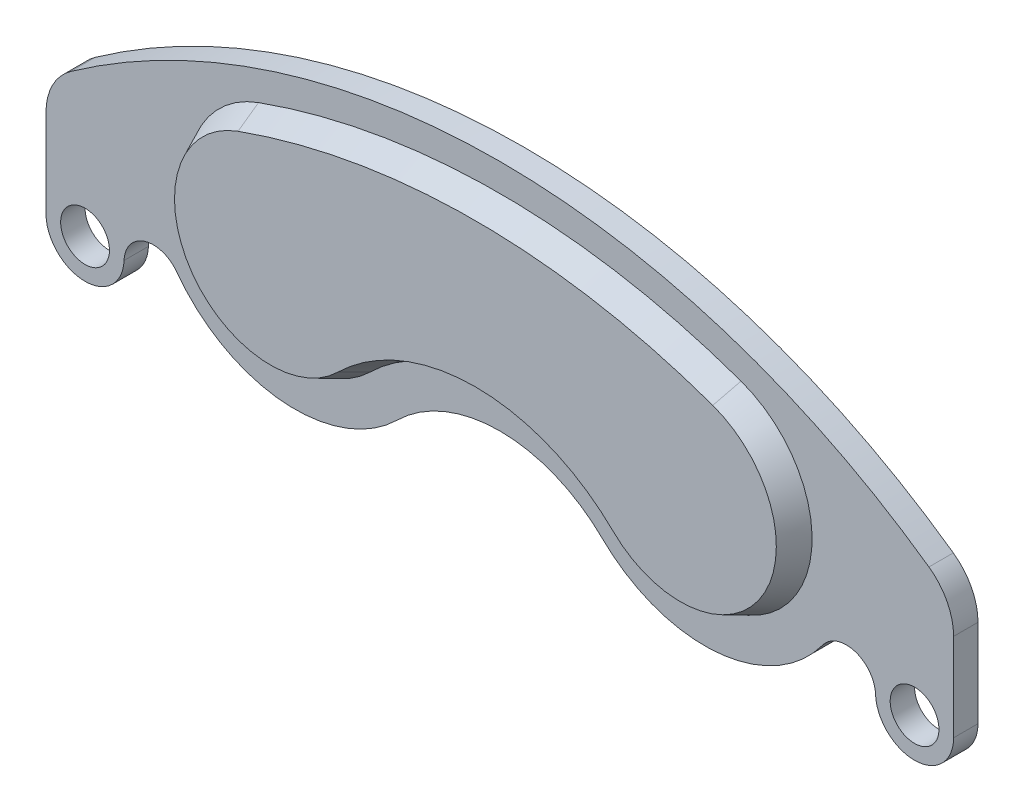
from build123d import *

# Parameters (mm, degrees)
SKETCH2_R           = 2.5
BOSS_EXTRUDE1_DEPTH = 1.25
BOSS_EXTRUDE2_DEPTH = 2.5
BOSS_EXTRUDE2_TAPER = 25


with BuildPart() as part:
    # Sketch2 → Boss-Extrude1 (new, symmetric)
    with BuildSketch(Plane.XY):
        with BuildLine():
            Line((46.5, 11.018505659), (46.5, 20.018505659))
            ThreePointArc((46.5, 20.018505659), (45.830505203, 22.772723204), (43.971428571, 24.912295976))
            ThreePointArc((43.971428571, 24.912295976), (23.074999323, 35.336607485), (0, 38.924285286))
            ThreePointArc((0, 38.924285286), (-23.074999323, 35.336607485), (-43.971428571, 24.912295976))
            ThreePointArc((-43.971428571, 24.912295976), (-45.830505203, 22.772723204), (-46.5, 20.018505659))
            Line((-46.5, 20.018505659), (-46.5, 11.018505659))
            ThreePointArc((-46.5, 11.018505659), (-42.572396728, 7.019160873), (-38.502620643, 10.873735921))
            ThreePointArc((-38.502620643, 10.873735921), (-36.387640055, 13.632250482), (-33.087155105, 12.541679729))
            ThreePointArc((-33.087155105, 12.541679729), (-22.211018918, 6.473250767), (-10.5, 10.712142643))
            ThreePointArc((-10.5, 10.712142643), (0, 15), (10.5, 10.712142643))
            ThreePointArc((10.5, 10.712142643), (22.211018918, 6.473250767), (33.087155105, 12.541679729))
            ThreePointArc((33.087155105, 12.541679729), (36.387640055, 13.632250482), (38.502620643, 10.873735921))
            ThreePointArc((38.502620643, 10.873735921), (42.572396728, 7.019160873), (46.5, 11.018505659))
        make_face()
        with Locations((-42.5, 11.018505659)):
            Circle(SKETCH2_R, mode=Mode.SUBTRACT)
        with Locations(Location((42.5, 11.018505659, 0), (0, 0, 180))):
            Circle(SKETCH2_R, mode=Mode.SUBTRACT)
    extrude(amount=BOSS_EXTRUDE1_DEPTH, both=True)

    # Sketch3 → Boss-Extrude2 (add)
    with BuildSketch(Plane.XY.offset(1.25)):
        with BuildLine():
            ThreePointArc((-13.3, 13.568714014), (0, 19), (13.3, 13.568714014))
            ThreePointArc((13.3, 13.568714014), (30.319675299, 15.581028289), (24.71651229, 31.777426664))
            ThreePointArc((24.71651229, 31.777426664), (0, 36.079333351), (-24.71651229, 31.777426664))
            ThreePointArc((-24.71651229, 31.777426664), (-30.319675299, 15.581028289), (-13.3, 13.568714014))
        make_face()
    extrude(amount=BOSS_EXTRUDE2_DEPTH, taper=BOSS_EXTRUDE2_TAPER)


solid = part.part
